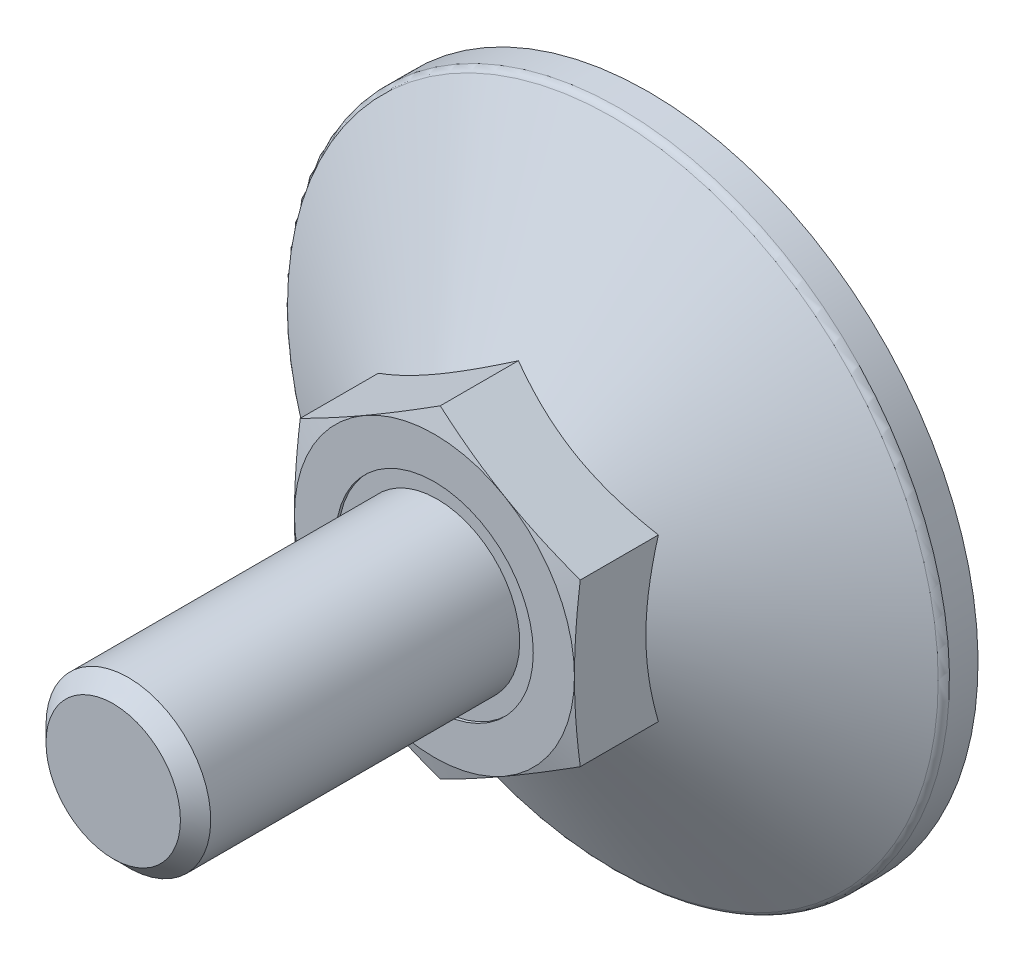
ISO-10303-21;
HEADER;
FILE_DESCRIPTION(('STEP AP214'),'2;1');
FILE_NAME('part.step','',(''),(''),'','','');
FILE_SCHEMA(('AUTOMOTIVE_DESIGN { 1 0 10303 214 1 1 1 1 }'));
ENDSEC;
DATA;
#1=APPLICATION_CONTEXT('core data for automotive mechanical design processes');
#2=APPLICATION_PROTOCOL_DEFINITION('international standard','automotive_design',2000,#1);
#3=PRODUCT_CONTEXT('',#1,'mechanical');
#4=PRODUCT('Part','Part','',(#3));
#5=PRODUCT_RELATED_PRODUCT_CATEGORY('part','',(#4));
#6=PRODUCT_DEFINITION_FORMATION('','',#4);
#7=PRODUCT_DEFINITION_CONTEXT('part definition',#1,'design');
#8=PRODUCT_DEFINITION('design','',#6,#7);
#9=PRODUCT_DEFINITION_SHAPE('','',#8);
#10=(LENGTH_UNIT() NAMED_UNIT(*) SI_UNIT(.MILLI.,.METRE.));
#11=(NAMED_UNIT(*) PLANE_ANGLE_UNIT() SI_UNIT($,.RADIAN.));
#12=(NAMED_UNIT(*) SI_UNIT($,.STERADIAN.) SOLID_ANGLE_UNIT());
#13=UNCERTAINTY_MEASURE_WITH_UNIT(LENGTH_MEASURE(1.E-05),#10,'distance_accuracy_value','');
#14=(GEOMETRIC_REPRESENTATION_CONTEXT(3) GLOBAL_UNCERTAINTY_ASSIGNED_CONTEXT((#13)) GLOBAL_UNIT_ASSIGNED_CONTEXT((#10,
#11,#12)) REPRESENTATION_CONTEXT('',''));
#15=CARTESIAN_POINT('',(0.,0.,0.));
#16=DIRECTION('',(0.,0.,1.));
#17=DIRECTION('',(1.,0.,0.));
#18=AXIS2_PLACEMENT_3D('',#15,#16,#17);
#19=CARTESIAN_POINT('',(0.,9.8149545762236,27.));
#20=DIRECTION('',(0.5,-0.86602540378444,0.));
#21=DIRECTION('',(0.86602540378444,0.5,0.));
#22=AXIS2_PLACEMENT_3D('',#19,#20,#21);
#23=PLANE('',#22);
#24=CARTESIAN_POINT('',(0.000200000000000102,9.81507004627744,12.6476280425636));
#25=CARTESIAN_POINT('',(-0.352800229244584,9.61126526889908,12.7022599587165));
#26=CARTESIAN_POINT('',(-0.706440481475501,9.40709097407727,12.7518566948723));
#27=CARTESIAN_POINT('',(-1.41496987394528,8.99802133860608,12.8389934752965));
#28=CARTESIAN_POINT('',(-1.76985946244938,8.79312573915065,12.8765286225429));
#29=CARTESIAN_POINT('',(-2.47873586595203,8.38385575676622,12.9373509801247));
#30=CARTESIAN_POINT('',(-2.83271788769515,8.17948414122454,12.9607107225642));
#31=CARTESIAN_POINT('',(-3.5411333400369,7.77048028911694,12.9920337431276));
#32=CARTESIAN_POINT('',(-3.89556667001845,7.56584811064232,13.));
#33=CARTESIAN_POINT('',(-4.60443332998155,7.15658375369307,13.));
#34=CARTESIAN_POINT('',(-4.9588666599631,6.95195157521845,12.9920337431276));
#35=CARTESIAN_POINT('',(-5.66728211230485,6.54294772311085,12.9607107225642));
#36=CARTESIAN_POINT('',(-6.02126413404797,6.33857610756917,12.9373509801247));
#37=CARTESIAN_POINT('',(-6.73014053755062,5.92930612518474,12.8765286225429));
#38=CARTESIAN_POINT('',(-7.08503012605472,5.7244105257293,12.8389934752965));
#39=CARTESIAN_POINT('',(-7.7935595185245,5.31534089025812,12.7518566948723));
#40=CARTESIAN_POINT('',(-8.14719977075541,5.11116659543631,12.7022599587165));
#41=CARTESIAN_POINT('',(-8.5002,4.90736181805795,12.6476280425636));
#42=B_SPLINE_CURVE_WITH_KNOTS('',3,(#24,#25,#26,#27,#28,#29,#30,#31,#32,#33,#34,#35,#36,#37,#38,
#39,#40,#41),.UNSPECIFIED.,.F.,.F.,(4,2,2,2,2,2,2,2,4),(0.,1.23382789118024,2.46815608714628,
3.69611406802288,4.92383440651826,6.15155474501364,7.37951272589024,8.61384092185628,
9.84766881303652),.UNSPECIFIED.);
#43=CARTESIAN_POINT('',(0.,9.8149545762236,12.6476589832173));
#44=VERTEX_POINT('',#43);
#45=CARTESIAN_POINT('',(-4.25,7.3612159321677,13.));
#46=VERTEX_POINT('',#45);
#47=EDGE_CURVE('E268',#44,#46,#42,.T.);
#48=ORIENTED_EDGE('',*,*,#47,.F.);
#49=DIRECTION('',(0.,0.,-1.));
#50=VECTOR('',#49,1.);
#51=CARTESIAN_POINT('',(0.,9.8149545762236,27.));
#52=LINE('',#51,#50);
#53=CARTESIAN_POINT('',(0.,9.8149545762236,7.90533871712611));
#54=VERTEX_POINT('',#53);
#55=EDGE_CURVE('E43',#44,#54,#52,.T.);
#56=ORIENTED_EDGE('',*,*,#55,.T.);
#57=CARTESIAN_POINT('',(-8.5002,4.90736181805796,7.90527204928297));
#58=CARTESIAN_POINT('',(-8.31336077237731,5.0152334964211,7.96754195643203));
#59=CARTESIAN_POINT('',(-8.1258249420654,5.12350735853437,8.02698579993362));
#60=CARTESIAN_POINT('',(-7.74923024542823,5.34093440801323,8.13944298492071));
#61=CARTESIAN_POINT('',(-7.56017075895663,5.45008795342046,8.19245355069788));
#62=CARTESIAN_POINT('',(-6.98996524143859,5.77929626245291,8.34079470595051));
#63=CARTESIAN_POINT('',(-6.60656835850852,6.00065055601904,8.42516916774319));
#64=CARTESIAN_POINT('',(-6.03282233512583,6.33190297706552,8.52410807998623));
#65=CARTESIAN_POINT('',(-5.8441872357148,6.44081150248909,8.55229289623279));
#66=CARTESIAN_POINT('',(-5.46606397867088,6.65912106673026,8.59955401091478));
#67=CARTESIAN_POINT('',(-5.27657589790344,6.76852206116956,8.61863111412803));
#68=CARTESIAN_POINT('',(-4.89727347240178,6.98751241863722,8.64719332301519));
#69=CARTESIAN_POINT('',(-4.70745974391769,7.0971014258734,8.65668931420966));
#70=CARTESIAN_POINT('',(-4.3276569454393,7.31638067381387,8.66588571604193));
#71=CARTESIAN_POINT('',(-4.13766788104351,7.42607091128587,8.66558642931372));
#72=CARTESIAN_POINT('',(-3.78247698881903,7.63114046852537,8.65587362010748));
#73=CARTESIAN_POINT('',(-3.61725009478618,7.7265342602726,8.64764492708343));
#74=CARTESIAN_POINT('',(-3.28718328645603,7.91709842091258,8.62393885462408));
#75=CARTESIAN_POINT('',(-3.12234339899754,8.01226877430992,8.60846098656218));
#76=CARTESIAN_POINT('',(-2.62846189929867,8.29741139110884,8.55151947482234));
#77=CARTESIAN_POINT('',(-2.30029449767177,8.48687892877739,8.49955503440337));
#78=CARTESIAN_POINT('',(-1.64047857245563,8.86782383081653,8.36964315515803));
#79=CARTESIAN_POINT('',(-1.30891425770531,9.0592525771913,8.29114502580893));
#80=CARTESIAN_POINT('',(-0.650730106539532,9.43925537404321,8.11298675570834));
#81=CARTESIAN_POINT('',(-0.324101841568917,9.62783429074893,8.01336845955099));
#82=CARTESIAN_POINT('',(0.000199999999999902,9.81507004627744,7.90527204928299));
#83=B_SPLINE_CURVE_WITH_KNOTS('',3,(#57,#58,#59,#60,#61,#62,#63,#64,#65,#66,#67,#68,#69,#70,#71,
#72,#73,#74,#75,#76,#77,#78,#79,#80,#81,#82),.UNSPECIFIED.,.F.,.F.,(4,2,2,2,2,2,2,2,2,2,2,2,4),
(0.,0.673596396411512,1.34748239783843,2.69805431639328,3.35679995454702,4.01548737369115,
4.67342558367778,5.33134346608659,5.90409556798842,6.47688628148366,7.62328361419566,
8.79510569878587,9.96462743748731),.UNSPECIFIED.);
#84=CARTESIAN_POINT('',(-8.5,4.9074772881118,7.90533871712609));
#85=VERTEX_POINT('',#84);
#86=EDGE_CURVE('E236',#85,#54,#83,.T.);
#87=ORIENTED_EDGE('',*,*,#86,.F.);
#88=DIRECTION('',(0.,0.,-1.));
#89=VECTOR('',#88,1.);
#90=CARTESIAN_POINT('',(-8.5,4.9074772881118,27.));
#91=LINE('',#90,#89);
#92=CARTESIAN_POINT('',(-8.5,4.9074772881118,12.6476589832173));
#93=VERTEX_POINT('',#92);
#94=EDGE_CURVE('E281',#93,#85,#91,.T.);
#95=ORIENTED_EDGE('',*,*,#94,.F.);
#96=EDGE_CURVE('E168',#46,#93,#42,.T.);
#97=ORIENTED_EDGE('',*,*,#96,.F.);
#98=EDGE_LOOP('',(#48,#56,#87,#95,#97));
#99=FACE_BOUND('',#98,.T.);
#100=ADVANCED_FACE('F14',(#99),#23,.F.);
#101=CARTESIAN_POINT('',(8.5,4.9074772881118,27.));
#102=DIRECTION('',(-0.5,-0.86602540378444,0.));
#103=DIRECTION('',(0.86602540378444,-0.5,0.));
#104=AXIS2_PLACEMENT_3D('',#101,#102,#103);
#105=PLANE('',#104);
#106=CARTESIAN_POINT('',(8.5002,4.90736181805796,12.6476280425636));
#107=CARTESIAN_POINT('',(8.14719977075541,5.11116659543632,12.7022599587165));
#108=CARTESIAN_POINT('',(7.7935595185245,5.31534089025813,12.7518566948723));
#109=CARTESIAN_POINT('',(7.08503012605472,5.72441052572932,12.8389934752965));
#110=CARTESIAN_POINT('',(6.73014053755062,5.92930612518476,12.8765286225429));
#111=CARTESIAN_POINT('',(6.02126413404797,6.33857610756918,12.9373509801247));
#112=CARTESIAN_POINT('',(5.66728211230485,6.54294772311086,12.9607107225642));
#113=CARTESIAN_POINT('',(4.9588666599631,6.95195157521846,12.9920337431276));
#114=CARTESIAN_POINT('',(4.60443332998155,7.15658375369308,13.));
#115=CARTESIAN_POINT('',(3.89556667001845,7.56584811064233,13.));
#116=CARTESIAN_POINT('',(3.5411333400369,7.77048028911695,12.9920337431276));
#117=CARTESIAN_POINT('',(2.83271788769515,8.17948414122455,12.9607107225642));
#118=CARTESIAN_POINT('',(2.47873586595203,8.38385575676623,12.9373509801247));
#119=CARTESIAN_POINT('',(1.76985946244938,8.79312573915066,12.8765286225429));
#120=CARTESIAN_POINT('',(1.41496987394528,8.9980213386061,12.8389934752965));
#121=CARTESIAN_POINT('',(0.706440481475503,9.40709097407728,12.7518566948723));
#122=CARTESIAN_POINT('',(0.352800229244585,9.61126526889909,12.7022599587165));
#123=CARTESIAN_POINT('',(-0.000200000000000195,9.81507004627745,12.6476280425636));
#124=B_SPLINE_CURVE_WITH_KNOTS('',3,(#106,#107,#108,#109,#110,#111,#112,#113,#114,#115,#116,
#117,#118,#119,#120,#121,#122,#123),.UNSPECIFIED.,.F.,.F.,(4,2,2,2,2,2,2,2,4),(0.,
1.23382789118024,2.46815608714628,3.69611406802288,4.92383440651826,6.15155474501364,
7.37951272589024,8.61384092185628,9.84766881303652),.UNSPECIFIED.);
#125=CARTESIAN_POINT('',(8.5,4.9074772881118,12.6476589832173));
#126=VERTEX_POINT('',#125);
#127=CARTESIAN_POINT('',(4.25,7.36121593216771,13.));
#128=VERTEX_POINT('',#127);
#129=EDGE_CURVE('E120',#126,#128,#124,.T.);
#130=ORIENTED_EDGE('',*,*,#129,.F.);
#131=DIRECTION('',(0.,0.,-1.));
#132=VECTOR('',#131,1.);
#133=CARTESIAN_POINT('',(8.5,4.9074772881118,27.));
#134=LINE('',#133,#132);
#135=CARTESIAN_POINT('',(8.5,4.9074772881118,7.90533871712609));
#136=VERTEX_POINT('',#135);
#137=EDGE_CURVE('E127',#126,#136,#134,.T.);
#138=ORIENTED_EDGE('',*,*,#137,.T.);
#139=CARTESIAN_POINT('',(-0.0002,9.81507004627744,7.90527204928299));
#140=CARTESIAN_POINT('',(0.186639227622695,9.7071983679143,7.96754195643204));
#141=CARTESIAN_POINT('',(0.374175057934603,9.59892450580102,8.02698579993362));
#142=CARTESIAN_POINT('',(0.750769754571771,9.38149745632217,8.13944298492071));
#143=CARTESIAN_POINT('',(0.939829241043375,9.27234391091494,8.19245355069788));
#144=CARTESIAN_POINT('',(1.51003475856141,8.94313560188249,8.34079470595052));
#145=CARTESIAN_POINT('',(1.89343164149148,8.72178130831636,8.42516916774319));
#146=CARTESIAN_POINT('',(2.46717766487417,8.39052888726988,8.52410807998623));
#147=CARTESIAN_POINT('',(2.6558127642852,8.28162036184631,8.55229289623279));
#148=CARTESIAN_POINT('',(3.03393602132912,8.06331079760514,8.59955401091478));
#149=CARTESIAN_POINT('',(3.22342410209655,7.95390980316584,8.61863111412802));
#150=CARTESIAN_POINT('',(3.60272652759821,7.73491944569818,8.64719332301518));
#151=CARTESIAN_POINT('',(3.79254025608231,7.62533043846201,8.65668931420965));
#152=CARTESIAN_POINT('',(4.1723430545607,7.40605119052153,8.66588571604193));
#153=CARTESIAN_POINT('',(4.36233211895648,7.29636095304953,8.66558642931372));
#154=CARTESIAN_POINT('',(4.71752301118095,7.09129139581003,8.65587362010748));
#155=CARTESIAN_POINT('',(4.88274990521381,6.9958976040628,8.64764492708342));
#156=CARTESIAN_POINT('',(5.21281671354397,6.80533344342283,8.62393885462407));
#157=CARTESIAN_POINT('',(5.37765660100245,6.71016309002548,8.60846098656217));
#158=CARTESIAN_POINT('',(5.87153810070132,6.42502047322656,8.55151947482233));
#159=CARTESIAN_POINT('',(6.19970550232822,6.23555293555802,8.49955503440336));
#160=CARTESIAN_POINT('',(6.85952142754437,5.85460803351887,8.36964315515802));
#161=CARTESIAN_POINT('',(7.19108574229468,5.6631792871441,8.29114502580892));
#162=CARTESIAN_POINT('',(7.84926989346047,5.28317649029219,8.11298675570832));
#163=CARTESIAN_POINT('',(8.17589815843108,5.09459757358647,8.01336845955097));
#164=CARTESIAN_POINT('',(8.5002,4.90736181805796,7.90527204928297));
#165=B_SPLINE_CURVE_WITH_KNOTS('',3,(#139,#140,#141,#142,#143,#144,#145,#146,#147,#148,#149,
#150,#151,#152,#153,#154,#155,#156,#157,#158,#159,#160,#161,#162,#163,#164),.UNSPECIFIED.,.F.,
.F.,(4,2,2,2,2,2,2,2,2,2,2,2,4),(0.,0.673596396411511,1.34748239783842,2.69805431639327,
3.35679995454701,4.01548737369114,4.67342558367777,5.33134346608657,5.90409556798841,
6.47688628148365,7.62328361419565,8.79510569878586,9.96462743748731),.UNSPECIFIED.);
#166=EDGE_CURVE('E230',#54,#136,#165,.T.);
#167=ORIENTED_EDGE('',*,*,#166,.F.);
#168=ORIENTED_EDGE('',*,*,#55,.F.);
#169=EDGE_CURVE('E137',#128,#44,#124,.T.);
#170=ORIENTED_EDGE('',*,*,#169,.F.);
#171=EDGE_LOOP('',(#130,#138,#167,#168,#170));
#172=FACE_BOUND('',#171,.T.);
#173=ADVANCED_FACE('F242',(#172),#105,.F.);
#174=CARTESIAN_POINT('',(8.5,-4.9074772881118,27.));
#175=DIRECTION('',(-1.,0.,0.));
#176=DIRECTION('',(0.,-1.,0.));
#177=AXIS2_PLACEMENT_3D('',#174,#175,#176);
#178=PLANE('',#177);
#179=CARTESIAN_POINT('',(8.5,-13.0013964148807,11.1154079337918));
#180=CARTESIAN_POINT('',(8.5,-12.6155551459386,11.2019183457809));
#181=CARTESIAN_POINT('',(8.5,-12.2294730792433,11.2873739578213));
#182=CARTESIAN_POINT('',(8.5,-11.4567090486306,11.4556061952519));
#183=CARTESIAN_POINT('',(8.5,-11.0700270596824,11.5383827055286));
#184=CARTESIAN_POINT('',(8.5,-10.2956012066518,11.7007588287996));
#185=CARTESIAN_POINT('',(8.5,-9.90785667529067,11.7803552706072));
#186=CARTESIAN_POINT('',(8.5,-9.13156196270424,11.9355151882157));
#187=CARTESIAN_POINT('',(8.5,-8.74301178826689,12.0110786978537));
#188=CARTESIAN_POINT('',(8.5,-7.96806084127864,12.1566302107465));
#189=CARTESIAN_POINT('',(8.5,-7.58166753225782,12.2266577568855));
#190=CARTESIAN_POINT('',(8.5,-6.80782802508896,12.3606202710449));
#191=CARTESIAN_POINT('',(8.5,-6.42038185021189,12.4245553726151));
#192=CARTESIAN_POINT('',(8.5,-5.64435908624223,12.5448975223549));
#193=CARTESIAN_POINT('',(8.5,-5.25578263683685,12.6013054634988));
#194=CARTESIAN_POINT('',(8.5,-4.47739258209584,12.7049345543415));
#195=CARTESIAN_POINT('',(8.5,-4.08757897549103,12.7521556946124));
#196=CARTESIAN_POINT('',(8.5,-3.30230870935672,12.8360782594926));
#197=CARTESIAN_POINT('',(8.5,-2.90683837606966,12.8726536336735));
#198=CARTESIAN_POINT('',(8.5,-2.11489932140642,12.9327640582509));
#199=CARTESIAN_POINT('',(8.5,-1.71843062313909,12.956299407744));
#200=CARTESIAN_POINT('',(8.5,-0.925070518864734,12.9889573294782));
#201=CARTESIAN_POINT('',(8.5,-0.528179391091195,12.9980865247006));
#202=CARTESIAN_POINT('',(8.5,0.265665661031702,13.0013704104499));
#203=CARTESIAN_POINT('',(8.5,0.662619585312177,12.9955251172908));
#204=CARTESIAN_POINT('',(8.5,1.45747811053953,12.9691885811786));
#205=CARTESIAN_POINT('',(8.5,1.85538091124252,12.9486440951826));
#206=CARTESIAN_POINT('',(8.5,2.65025329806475,12.8940836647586));
#207=CARTESIAN_POINT('',(8.5,3.04722286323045,12.8600674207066));
#208=CARTESIAN_POINT('',(8.5,3.84022498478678,12.7802865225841));
#209=CARTESIAN_POINT('',(8.5,4.2362567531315,12.7345141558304));
#210=CARTESIAN_POINT('',(8.5,5.02704500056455,12.6331315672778));
#211=CARTESIAN_POINT('',(8.5,5.42180147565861,12.5775213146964));
#212=CARTESIAN_POINT('',(8.5,6.18542338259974,12.4619782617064));
#213=CARTESIAN_POINT('',(8.5,6.55436342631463,12.4025335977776));
#214=CARTESIAN_POINT('',(8.5,7.29126654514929,12.2778420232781));
#215=CARTESIAN_POINT('',(8.5,7.65922959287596,12.2125949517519));
#216=CARTESIAN_POINT('',(8.5,8.39431434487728,12.0773627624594));
#217=CARTESIAN_POINT('',(8.5,8.76143596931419,12.0073772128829));
#218=CARTESIAN_POINT('',(8.5,9.49492383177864,11.8635427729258));
#219=CARTESIAN_POINT('',(8.5,9.86129005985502,11.7896938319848));
#220=CARTESIAN_POINT('',(8.5,10.5934540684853,11.6388171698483));
#221=CARTESIAN_POINT('',(8.5,10.9592516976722,11.5617887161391));
#222=CARTESIAN_POINT('',(8.5,11.6902889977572,11.4051243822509));
#223=CARTESIAN_POINT('',(8.5,12.0555286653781,11.3254884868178));
#224=CARTESIAN_POINT('',(8.5,13.1504861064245,11.0833759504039));
#225=CARTESIAN_POINT('',(8.5,13.8794926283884,10.9176839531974));
#226=CARTESIAN_POINT('',(8.5,15.3289393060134,10.5819886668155));
#227=CARTESIAN_POINT('',(8.5,16.0493931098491,10.412043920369));
#228=CARTESIAN_POINT('',(8.5,17.4892972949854,10.0679042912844));
#229=CARTESIAN_POINT('',(8.5,18.2087476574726,9.89370933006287));
#230=CARTESIAN_POINT('',(8.5,19.6459829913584,9.54240508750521));
#231=CARTESIAN_POINT('',(8.5,20.3637689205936,9.36529971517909));
#232=CARTESIAN_POINT('',(8.5,21.798716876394,9.00867881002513));
#233=CARTESIAN_POINT('',(8.5,22.5158789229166,8.8291633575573));
#234=CARTESIAN_POINT('',(8.5,23.2328239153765,8.64879480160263));
#235=B_SPLINE_CURVE_WITH_KNOTS('',3,(#179,#180,#181,#182,#183,#184,#185,#186,#187,#188,#189,
#190,#191,#192,#193,#194,#195,#196,#197,#198,#199,#200,#201,#202,#203,#204,#205,#206,#207,#208,
#209,#210,#211,#212,#213,#214,#215,#216,#217,#218,#219,#220,#221,#222,#223,#224,#225,#226,#227,
#228,#229,#230,#231,#232,#233,#234),.UNSPECIFIED.,.F.,.F.,(4,2,2,2,2,2,2,2,2,2,2,2,2,2,2,2,2,2,
2,2,2,2,2,2,2,2,2,4),(0.,1.18626692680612,2.37258475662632,3.56005747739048,4.74752023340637,
5.92554444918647,7.10354283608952,8.28140134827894,9.45926106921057,10.6505472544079,
11.8418061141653,13.032517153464,14.2232268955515,15.4182715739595,16.6133428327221,
17.8092001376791,19.0050611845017,20.1261014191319,21.2471727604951,22.3683464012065,
23.4895347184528,24.6109827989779,25.7324374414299,27.9751925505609,30.1958563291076,
32.4165611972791,34.6344942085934,36.8523534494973),.UNSPECIFIED.);
#236=CARTESIAN_POINT('',(8.5,-4.90747728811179,12.6476589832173));
#237=VERTEX_POINT('',#236);
#238=CARTESIAN_POINT('',(8.5,0.,13.));
#239=VERTEX_POINT('',#238);
#240=EDGE_CURVE('E95',#237,#239,#235,.T.);
#241=ORIENTED_EDGE('',*,*,#240,.F.);
#242=DIRECTION('',(0.,0.,-1.));
#243=VECTOR('',#242,1.);
#244=CARTESIAN_POINT('',(8.5,-4.9074772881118,27.));
#245=LINE('',#244,#243);
#246=CARTESIAN_POINT('',(8.5,-4.9074772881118,7.90533871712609));
#247=VERTEX_POINT('',#246);
#248=EDGE_CURVE('E274',#237,#247,#245,.T.);
#249=ORIENTED_EDGE('',*,*,#248,.T.);
#250=CARTESIAN_POINT('',(8.5,12.7492767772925,4.72527230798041));
#251=CARTESIAN_POINT('',(8.5,12.3811478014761,4.90206026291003));
#252=CARTESIAN_POINT('',(8.5,12.0121249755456,5.07702151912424));
#253=CARTESIAN_POINT('',(8.5,11.2718137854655,5.42225230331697));
#254=CARTESIAN_POINT('',(8.5,10.9005250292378,5.59252098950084));
#255=CARTESIAN_POINT('',(8.5,10.1530767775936,5.92827896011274));
#256=CARTESIAN_POINT('',(8.5,9.77690140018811,6.09373302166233));
#257=CARTESIAN_POINT('',(8.5,9.02139912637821,6.41725455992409));
#258=CARTESIAN_POINT('',(8.5,8.64207239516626,6.57532242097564));
#259=CARTESIAN_POINT('',(8.5,7.86979942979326,6.88607334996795));
#260=CARTESIAN_POINT('',(8.5,7.47675434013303,7.03851219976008));
#261=CARTESIAN_POINT('',(8.5,6.68591204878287,7.33076935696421));
#262=CARTESIAN_POINT('',(8.5,6.28811429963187,7.47058619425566));
#263=CARTESIAN_POINT('',(8.5,5.48802263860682,7.733611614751));
#264=CARTESIAN_POINT('',(8.5,5.08574124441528,7.85685783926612));
#265=CARTESIAN_POINT('',(8.5,4.27544970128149,8.08251258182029));
#266=CARTESIAN_POINT('',(8.5,3.86744153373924,8.18492812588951));
#267=CARTESIAN_POINT('',(8.5,3.04728386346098,8.36327495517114));
#268=CARTESIAN_POINT('',(8.5,2.6351585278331,8.43931422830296));
#269=CARTESIAN_POINT('',(8.5,2.01359122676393,8.53003978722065));
#270=CARTESIAN_POINT('',(8.5,1.80582110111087,8.55639399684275));
#271=CARTESIAN_POINT('',(8.5,1.38940213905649,8.60080126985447));
#272=CARTESIAN_POINT('',(8.5,1.18075338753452,8.61885511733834));
#273=CARTESIAN_POINT('',(8.5,0.765376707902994,8.64609671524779));
#274=CARTESIAN_POINT('',(8.5,0.558655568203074,8.65538769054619));
#275=CARTESIAN_POINT('',(8.5,0.1450067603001,8.66526416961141));
#276=CARTESIAN_POINT('',(8.5,-0.0619209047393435,8.6658498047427));
#277=CARTESIAN_POINT('',(8.5,-0.475626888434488,8.65830085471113));
#278=CARTESIAN_POINT('',(8.5,-0.682405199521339,8.65016585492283));
#279=CARTESIAN_POINT('',(8.5,-1.09545270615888,8.625363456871));
#280=CARTESIAN_POINT('',(8.5,-1.30172187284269,8.60869558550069));
#281=CARTESIAN_POINT('',(8.5,-1.81090940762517,8.55735076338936));
#282=CARTESIAN_POINT('',(8.5,-2.11335210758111,8.51788364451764));
#283=CARTESIAN_POINT('',(8.5,-2.71570235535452,8.4228634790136));
#284=CARTESIAN_POINT('',(8.5,-3.01560949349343,8.36730788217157));
#285=CARTESIAN_POINT('',(8.5,-3.61268959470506,8.2420877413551));
#286=CARTESIAN_POINT('',(8.5,-3.90986014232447,8.17241178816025));
#287=CARTESIAN_POINT('',(8.5,-4.50108875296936,8.02104250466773));
#288=CARTESIAN_POINT('',(8.5,-4.79514688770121,7.93934945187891));
#289=CARTESIAN_POINT('',(8.5,-5.3871494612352,7.7638116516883));
#290=CARTESIAN_POINT('',(8.5,-5.68502188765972,7.6697256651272));
#291=CARTESIAN_POINT('',(8.5,-6.27782977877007,7.4727599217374));
#292=CARTESIAN_POINT('',(8.5,-6.57276522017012,7.36988009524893));
#293=CARTESIAN_POINT('',(8.5,-7.15987047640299,7.15687683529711));
#294=CARTESIAN_POINT('',(8.5,-7.45204129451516,7.04675615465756));
#295=CARTESIAN_POINT('',(8.5,-8.03401937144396,6.82048197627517));
#296=CARTESIAN_POINT('',(8.5,-8.32382669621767,6.70432864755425));
#297=CARTESIAN_POINT('',(8.5,-8.8985343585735,6.468166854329));
#298=CARTESIAN_POINT('',(8.5,-9.18345493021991,6.34820749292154));
#299=CARTESIAN_POINT('',(8.5,-9.75152375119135,6.10415692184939));
#300=CARTESIAN_POINT('',(8.5,-10.034671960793,5.98006561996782));
#301=CARTESIAN_POINT('',(8.5,-10.8818575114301,5.60257794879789));
#302=CARTESIAN_POINT('',(8.5,-11.4435817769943,5.34399030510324));
#303=CARTESIAN_POINT('',(8.5,-12.5625477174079,4.81675169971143));
#304=CARTESIAN_POINT('',(8.5,-13.1197873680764,4.54809647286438));
#305=CARTESIAN_POINT('',(8.5,-14.2306052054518,4.00340707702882));
#306=CARTESIAN_POINT('',(8.5,-14.7841835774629,3.72737328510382));
#307=CARTESIAN_POINT('',(8.5,-15.8894273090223,3.16924748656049));
#308=CARTESIAN_POINT('',(8.5,-16.4410879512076,2.88714616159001));
#309=CARTESIAN_POINT('',(8.5,-17.5421722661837,2.31860293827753));
#310=CARTESIAN_POINT('',(8.5,-18.0915959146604,2.03216099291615));
#311=CARTESIAN_POINT('',(8.5,-19.1885131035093,1.45593769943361));
#312=CARTESIAN_POINT('',(8.5,-19.7360070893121,1.1661571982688));
#313=CARTESIAN_POINT('',(8.5,-20.8295421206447,0.583866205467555));
#314=CARTESIAN_POINT('',(8.5,-21.3755831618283,0.291355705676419));
#315=CARTESIAN_POINT('',(8.5,-22.8810608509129,-0.519031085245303));
#316=CARTESIAN_POINT('',(8.5,-23.8392547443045,-1.03921546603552));
#317=CARTESIAN_POINT('',(8.5,-25.7530641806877,-2.08445783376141));
#318=CARTESIAN_POINT('',(8.5,-26.708679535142,-2.60951616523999));
#319=CARTESIAN_POINT('',(8.5,-28.6148788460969,-3.66152013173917));
#320=CARTESIAN_POINT('',(8.5,-29.565469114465,-4.18845433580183));
#321=CARTESIAN_POINT('',(8.5,-30.9901906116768,-4.98085413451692));
#322=CARTESIAN_POINT('',(8.5,-31.4648842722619,-5.24530955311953));
#323=CARTESIAN_POINT('',(8.5,-32.4139385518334,-5.77481644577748));
#324=CARTESIAN_POINT('',(8.5,-32.8882991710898,-6.03986791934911));
#325=CARTESIAN_POINT('',(8.5,-33.3625145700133,-6.30517901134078));
#326=B_SPLINE_CURVE_WITH_KNOTS('',3,(#250,#251,#252,#253,#254,#255,#256,#257,#258,#259,#260,
#261,#262,#263,#264,#265,#266,#267,#268,#269,#270,#271,#272,#273,#274,#275,#276,#277,#278,#279,
#280,#281,#282,#283,#284,#285,#286,#287,#288,#289,#290,#291,#292,#293,#294,#295,#296,#297,#298,
#299,#300,#301,#302,#303,#304,#305,#306,#307,#308,#309,#310,#311,#312,#313,#314,#315,#316,#317,
#318,#319,#320,#321,#322,#323,#324,#325),.UNSPECIFIED.,.F.,.F.,(4,2,2,2,2,2,2,2,2,2,2,2,2,2,2,2,
2,2,2,2,2,2,2,2,2,2,2,2,2,2,2,2,2,2,2,2,2,4),(0.,1.22515253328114,2.45052343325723,
3.6833213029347,4.91605495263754,6.18059988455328,7.44529191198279,8.70706073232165,
9.96840325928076,11.2245189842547,11.852683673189,12.4807890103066,13.1013994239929,
13.7220004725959,14.3426310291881,14.9632960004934,15.8778021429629,16.7924533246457,
17.7078465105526,18.6232185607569,19.5601888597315,20.4971665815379,21.433790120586,
22.3703874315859,23.297780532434,24.225194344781,26.0801973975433,27.9359954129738,
29.7916987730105,31.6504906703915,33.5093027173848,35.3676531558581,37.2260091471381,
40.4968499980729,43.7679238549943,47.0285209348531,48.6586852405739,50.2888482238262),.UNSPECIFIED.);
#327=EDGE_CURVE('E196',#136,#247,#326,.T.);
#328=ORIENTED_EDGE('',*,*,#327,.F.);
#329=ORIENTED_EDGE('',*,*,#137,.F.);
#330=EDGE_CURVE('E106',#239,#126,#235,.T.);
#331=ORIENTED_EDGE('',*,*,#330,.F.);
#332=EDGE_LOOP('',(#241,#249,#328,#329,#331));
#333=FACE_BOUND('',#332,.T.);
#334=ADVANCED_FACE('F125',(#333),#178,.F.);
#335=CARTESIAN_POINT('',(0.,-9.8149545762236,27.));
#336=DIRECTION('',(-0.5,0.86602540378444,0.));
#337=DIRECTION('',(-0.86602540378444,-0.5,0.));
#338=AXIS2_PLACEMENT_3D('',#335,#336,#337);
#339=PLANE('',#338);
#340=CARTESIAN_POINT('',(-0.000200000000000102,-9.81507004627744,12.6476280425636));
#341=CARTESIAN_POINT('',(0.352800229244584,-9.61126526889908,12.7022599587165));
#342=CARTESIAN_POINT('',(0.706440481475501,-9.40709097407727,12.7518566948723));
#343=CARTESIAN_POINT('',(1.41496987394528,-8.99802133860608,12.8389934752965));
#344=CARTESIAN_POINT('',(1.76985946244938,-8.79312573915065,12.8765286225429));
#345=CARTESIAN_POINT('',(2.47873586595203,-8.38385575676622,12.9373509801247));
#346=CARTESIAN_POINT('',(2.83271788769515,-8.17948414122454,12.9607107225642));
#347=CARTESIAN_POINT('',(3.5411333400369,-7.77048028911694,12.9920337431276));
#348=CARTESIAN_POINT('',(3.89556667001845,-7.56584811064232,13.));
#349=CARTESIAN_POINT('',(4.60443332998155,-7.15658375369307,13.));
#350=CARTESIAN_POINT('',(4.9588666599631,-6.95195157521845,12.9920337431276));
#351=CARTESIAN_POINT('',(5.66728211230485,-6.54294772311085,12.9607107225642));
#352=CARTESIAN_POINT('',(6.02126413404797,-6.33857610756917,12.9373509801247));
#353=CARTESIAN_POINT('',(6.73014053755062,-5.92930612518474,12.8765286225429));
#354=CARTESIAN_POINT('',(7.08503012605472,-5.7244105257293,12.8389934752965));
#355=CARTESIAN_POINT('',(7.7935595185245,-5.31534089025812,12.7518566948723));
#356=CARTESIAN_POINT('',(8.14719977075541,-5.11116659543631,12.7022599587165));
#357=CARTESIAN_POINT('',(8.5002,-4.90736181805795,12.6476280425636));
#358=B_SPLINE_CURVE_WITH_KNOTS('',3,(#340,#341,#342,#343,#344,#345,#346,#347,#348,#349,#350,
#351,#352,#353,#354,#355,#356,#357),.UNSPECIFIED.,.F.,.F.,(4,2,2,2,2,2,2,2,4),(0.,
1.23382789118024,2.46815608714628,3.69611406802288,4.92383440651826,6.15155474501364,
7.37951272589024,8.61384092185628,9.84766881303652),.UNSPECIFIED.);
#359=CARTESIAN_POINT('',(0.,-9.81495457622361,12.6476589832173));
#360=VERTEX_POINT('',#359);
#361=CARTESIAN_POINT('',(4.25,-7.3612159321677,13.));
#362=VERTEX_POINT('',#361);
#363=EDGE_CURVE('E129',#360,#362,#358,.T.);
#364=ORIENTED_EDGE('',*,*,#363,.F.);
#365=DIRECTION('',(0.,0.,-1.));
#366=VECTOR('',#365,1.);
#367=CARTESIAN_POINT('',(0.,-9.8149545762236,27.));
#368=LINE('',#367,#366);
#369=CARTESIAN_POINT('',(0.,-9.8149545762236,7.90533871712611));
#370=VERTEX_POINT('',#369);
#371=EDGE_CURVE('E278',#360,#370,#368,.T.);
#372=ORIENTED_EDGE('',*,*,#371,.T.);
#373=CARTESIAN_POINT('',(8.5002,-4.90736181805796,7.90527204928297));
#374=CARTESIAN_POINT('',(8.31336077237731,-5.0152334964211,7.96754195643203));
#375=CARTESIAN_POINT('',(8.1258249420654,-5.12350735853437,8.02698579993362));
#376=CARTESIAN_POINT('',(7.74923024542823,-5.34093440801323,8.13944298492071));
#377=CARTESIAN_POINT('',(7.56017075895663,-5.45008795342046,8.19245355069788));
#378=CARTESIAN_POINT('',(6.98996524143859,-5.77929626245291,8.34079470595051));
#379=CARTESIAN_POINT('',(6.60656835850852,-6.00065055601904,8.42516916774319));
#380=CARTESIAN_POINT('',(6.03282233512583,-6.33190297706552,8.52410807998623));
#381=CARTESIAN_POINT('',(5.8441872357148,-6.44081150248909,8.55229289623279));
#382=CARTESIAN_POINT('',(5.46606397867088,-6.65912106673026,8.59955401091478));
#383=CARTESIAN_POINT('',(5.27657589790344,-6.76852206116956,8.61863111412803));
#384=CARTESIAN_POINT('',(4.89727347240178,-6.98751241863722,8.64719332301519));
#385=CARTESIAN_POINT('',(4.70745974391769,-7.0971014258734,8.65668931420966));
#386=CARTESIAN_POINT('',(4.3276569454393,-7.31638067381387,8.66588571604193));
#387=CARTESIAN_POINT('',(4.13766788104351,-7.42607091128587,8.66558642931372));
#388=CARTESIAN_POINT('',(3.78247698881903,-7.63114046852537,8.65587362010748));
#389=CARTESIAN_POINT('',(3.61725009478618,-7.7265342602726,8.64764492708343));
#390=CARTESIAN_POINT('',(3.28718328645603,-7.91709842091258,8.62393885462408));
#391=CARTESIAN_POINT('',(3.12234339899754,-8.01226877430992,8.60846098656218));
#392=CARTESIAN_POINT('',(2.62846189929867,-8.29741139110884,8.55151947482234));
#393=CARTESIAN_POINT('',(2.30029449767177,-8.48687892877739,8.49955503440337));
#394=CARTESIAN_POINT('',(1.64047857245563,-8.86782383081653,8.36964315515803));
#395=CARTESIAN_POINT('',(1.30891425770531,-9.0592525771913,8.29114502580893));
#396=CARTESIAN_POINT('',(0.650730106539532,-9.43925537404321,8.11298675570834));
#397=CARTESIAN_POINT('',(0.324101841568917,-9.62783429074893,8.01336845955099));
#398=CARTESIAN_POINT('',(-0.000199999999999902,-9.81507004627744,7.90527204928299));
#399=B_SPLINE_CURVE_WITH_KNOTS('',3,(#373,#374,#375,#376,#377,#378,#379,#380,#381,#382,#383,
#384,#385,#386,#387,#388,#389,#390,#391,#392,#393,#394,#395,#396,#397,#398),.UNSPECIFIED.,.F.,
.F.,(4,2,2,2,2,2,2,2,2,2,2,2,4),(0.,0.673596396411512,1.34748239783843,2.69805431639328,
3.35679995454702,4.01548737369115,4.67342558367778,5.33134346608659,5.90409556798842,
6.47688628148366,7.62328361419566,8.79510569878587,9.96462743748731),.UNSPECIFIED.);
#400=EDGE_CURVE('E187',#247,#370,#399,.T.);
#401=ORIENTED_EDGE('',*,*,#400,.F.);
#402=ORIENTED_EDGE('',*,*,#248,.F.);
#403=EDGE_CURVE('E101',#362,#237,#358,.T.);
#404=ORIENTED_EDGE('',*,*,#403,.F.);
#405=EDGE_LOOP('',(#364,#372,#401,#402,#404));
#406=FACE_BOUND('',#405,.T.);
#407=ADVANCED_FACE('F179',(#406),#339,.F.);
#408=CARTESIAN_POINT('',(-8.5,-4.9074772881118,27.));
#409=DIRECTION('',(0.5,0.86602540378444,0.));
#410=DIRECTION('',(-0.86602540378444,0.5,0.));
#411=AXIS2_PLACEMENT_3D('',#408,#409,#410);
#412=PLANE('',#411);
#413=CARTESIAN_POINT('',(-8.5002,-4.90736181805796,12.6476280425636));
#414=CARTESIAN_POINT('',(-8.14719977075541,-5.11116659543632,12.7022599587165));
#415=CARTESIAN_POINT('',(-7.7935595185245,-5.31534089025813,12.7518566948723));
#416=CARTESIAN_POINT('',(-7.08503012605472,-5.72441052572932,12.8389934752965));
#417=CARTESIAN_POINT('',(-6.73014053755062,-5.92930612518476,12.8765286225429));
#418=CARTESIAN_POINT('',(-6.02126413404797,-6.33857610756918,12.9373509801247));
#419=CARTESIAN_POINT('',(-5.66728211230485,-6.54294772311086,12.9607107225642));
#420=CARTESIAN_POINT('',(-4.9588666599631,-6.95195157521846,12.9920337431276));
#421=CARTESIAN_POINT('',(-4.60443332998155,-7.15658375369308,13.));
#422=CARTESIAN_POINT('',(-3.89556667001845,-7.56584811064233,13.));
#423=CARTESIAN_POINT('',(-3.5411333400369,-7.77048028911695,12.9920337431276));
#424=CARTESIAN_POINT('',(-2.83271788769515,-8.17948414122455,12.9607107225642));
#425=CARTESIAN_POINT('',(-2.47873586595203,-8.38385575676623,12.9373509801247));
#426=CARTESIAN_POINT('',(-1.76985946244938,-8.79312573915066,12.8765286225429));
#427=CARTESIAN_POINT('',(-1.41496987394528,-8.9980213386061,12.8389934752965));
#428=CARTESIAN_POINT('',(-0.706440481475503,-9.40709097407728,12.7518566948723));
#429=CARTESIAN_POINT('',(-0.352800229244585,-9.61126526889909,12.7022599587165));
#430=CARTESIAN_POINT('',(0.000200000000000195,-9.81507004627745,12.6476280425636));
#431=B_SPLINE_CURVE_WITH_KNOTS('',3,(#413,#414,#415,#416,#417,#418,#419,#420,#421,#422,#423,
#424,#425,#426,#427,#428,#429,#430),.UNSPECIFIED.,.F.,.F.,(4,2,2,2,2,2,2,2,4),(0.,
1.23382789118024,2.46815608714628,3.69611406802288,4.92383440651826,6.15155474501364,
7.37951272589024,8.61384092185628,9.84766881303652),.UNSPECIFIED.);
#432=CARTESIAN_POINT('',(-8.5,-4.9074772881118,12.6476589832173));
#433=VERTEX_POINT('',#432);
#434=CARTESIAN_POINT('',(-4.25,-7.36121593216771,13.));
#435=VERTEX_POINT('',#434);
#436=EDGE_CURVE('E159',#433,#435,#431,.T.);
#437=ORIENTED_EDGE('',*,*,#436,.F.);
#438=DIRECTION('',(0.,0.,-1.));
#439=VECTOR('',#438,1.);
#440=CARTESIAN_POINT('',(-8.5,-4.9074772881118,27.));
#441=LINE('',#440,#439);
#442=CARTESIAN_POINT('',(-8.5,-4.9074772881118,7.90533871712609));
#443=VERTEX_POINT('',#442);
#444=EDGE_CURVE('E280',#433,#443,#441,.T.);
#445=ORIENTED_EDGE('',*,*,#444,.T.);
#446=CARTESIAN_POINT('',(0.0002,-9.81507004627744,7.90527204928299));
#447=CARTESIAN_POINT('',(-0.186639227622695,-9.7071983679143,7.96754195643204));
#448=CARTESIAN_POINT('',(-0.374175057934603,-9.59892450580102,8.02698579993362));
#449=CARTESIAN_POINT('',(-0.750769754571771,-9.38149745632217,8.13944298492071));
#450=CARTESIAN_POINT('',(-0.939829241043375,-9.27234391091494,8.19245355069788));
#451=CARTESIAN_POINT('',(-1.51003475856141,-8.94313560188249,8.34079470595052));
#452=CARTESIAN_POINT('',(-1.89343164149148,-8.72178130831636,8.42516916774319));
#453=CARTESIAN_POINT('',(-2.46717766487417,-8.39052888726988,8.52410807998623));
#454=CARTESIAN_POINT('',(-2.6558127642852,-8.28162036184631,8.55229289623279));
#455=CARTESIAN_POINT('',(-3.03393602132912,-8.06331079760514,8.59955401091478));
#456=CARTESIAN_POINT('',(-3.22342410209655,-7.95390980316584,8.61863111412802));
#457=CARTESIAN_POINT('',(-3.60272652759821,-7.73491944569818,8.64719332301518));
#458=CARTESIAN_POINT('',(-3.79254025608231,-7.62533043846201,8.65668931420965));
#459=CARTESIAN_POINT('',(-4.1723430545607,-7.40605119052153,8.66588571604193));
#460=CARTESIAN_POINT('',(-4.36233211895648,-7.29636095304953,8.66558642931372));
#461=CARTESIAN_POINT('',(-4.71752301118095,-7.09129139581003,8.65587362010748));
#462=CARTESIAN_POINT('',(-4.88274990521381,-6.9958976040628,8.64764492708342));
#463=CARTESIAN_POINT('',(-5.21281671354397,-6.80533344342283,8.62393885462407));
#464=CARTESIAN_POINT('',(-5.37765660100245,-6.71016309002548,8.60846098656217));
#465=CARTESIAN_POINT('',(-5.87153810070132,-6.42502047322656,8.55151947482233));
#466=CARTESIAN_POINT('',(-6.19970550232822,-6.23555293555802,8.49955503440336));
#467=CARTESIAN_POINT('',(-6.85952142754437,-5.85460803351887,8.36964315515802));
#468=CARTESIAN_POINT('',(-7.19108574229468,-5.6631792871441,8.29114502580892));
#469=CARTESIAN_POINT('',(-7.84926989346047,-5.28317649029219,8.11298675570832));
#470=CARTESIAN_POINT('',(-8.17589815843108,-5.09459757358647,8.01336845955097));
#471=CARTESIAN_POINT('',(-8.5002,-4.90736181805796,7.90527204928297));
#472=B_SPLINE_CURVE_WITH_KNOTS('',3,(#446,#447,#448,#449,#450,#451,#452,#453,#454,#455,#456,
#457,#458,#459,#460,#461,#462,#463,#464,#465,#466,#467,#468,#469,#470,#471),.UNSPECIFIED.,.F.,
.F.,(4,2,2,2,2,2,2,2,2,2,2,2,4),(0.,0.673596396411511,1.34748239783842,2.69805431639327,
3.35679995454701,4.01548737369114,4.67342558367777,5.33134346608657,5.90409556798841,
6.47688628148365,7.62328361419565,8.79510569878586,9.96462743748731),.UNSPECIFIED.);
#473=EDGE_CURVE('E197',#370,#443,#472,.T.);
#474=ORIENTED_EDGE('',*,*,#473,.F.);
#475=ORIENTED_EDGE('',*,*,#371,.F.);
#476=EDGE_CURVE('E178',#435,#360,#431,.T.);
#477=ORIENTED_EDGE('',*,*,#476,.F.);
#478=EDGE_LOOP('',(#437,#445,#474,#475,#477));
#479=FACE_BOUND('',#478,.T.);
#480=ADVANCED_FACE('F182',(#479),#412,.F.);
#481=CARTESIAN_POINT('',(-8.5,4.9074772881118,27.));
#482=DIRECTION('',(1.,0.,0.));
#483=DIRECTION('',(0.,1.,0.));
#484=AXIS2_PLACEMENT_3D('',#481,#482,#483);
#485=PLANE('',#484);
#486=CARTESIAN_POINT('',(-8.5,-13.0013964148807,11.1154079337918));
#487=CARTESIAN_POINT('',(-8.5,-12.6155551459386,11.2019183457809));
#488=CARTESIAN_POINT('',(-8.5,-12.2294730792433,11.2873739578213));
#489=CARTESIAN_POINT('',(-8.5,-11.4567090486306,11.4556061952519));
#490=CARTESIAN_POINT('',(-8.5,-11.0700270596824,11.5383827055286));
#491=CARTESIAN_POINT('',(-8.5,-10.2956012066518,11.7007588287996));
#492=CARTESIAN_POINT('',(-8.5,-9.90785667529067,11.7803552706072));
#493=CARTESIAN_POINT('',(-8.5,-9.13156196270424,11.9355151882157));
#494=CARTESIAN_POINT('',(-8.5,-8.74301178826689,12.0110786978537));
#495=CARTESIAN_POINT('',(-8.5,-7.96806084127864,12.1566302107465));
#496=CARTESIAN_POINT('',(-8.5,-7.58166753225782,12.2266577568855));
#497=CARTESIAN_POINT('',(-8.5,-6.80782802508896,12.3606202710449));
#498=CARTESIAN_POINT('',(-8.5,-6.42038185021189,12.4245553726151));
#499=CARTESIAN_POINT('',(-8.5,-5.64435908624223,12.5448975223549));
#500=CARTESIAN_POINT('',(-8.5,-5.25578263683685,12.6013054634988));
#501=CARTESIAN_POINT('',(-8.5,-4.47739258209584,12.7049345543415));
#502=CARTESIAN_POINT('',(-8.5,-4.08757897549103,12.7521556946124));
#503=CARTESIAN_POINT('',(-8.5,-3.30230870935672,12.8360782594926));
#504=CARTESIAN_POINT('',(-8.5,-2.90683837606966,12.8726536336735));
#505=CARTESIAN_POINT('',(-8.5,-2.11489932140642,12.9327640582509));
#506=CARTESIAN_POINT('',(-8.5,-1.71843062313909,12.956299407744));
#507=CARTESIAN_POINT('',(-8.5,-0.925070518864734,12.9889573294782));
#508=CARTESIAN_POINT('',(-8.5,-0.528179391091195,12.9980865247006));
#509=CARTESIAN_POINT('',(-8.5,0.265665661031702,13.0013704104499));
#510=CARTESIAN_POINT('',(-8.5,0.662619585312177,12.9955251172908));
#511=CARTESIAN_POINT('',(-8.5,1.45747811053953,12.9691885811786));
#512=CARTESIAN_POINT('',(-8.5,1.85538091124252,12.9486440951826));
#513=CARTESIAN_POINT('',(-8.5,2.65025329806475,12.8940836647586));
#514=CARTESIAN_POINT('',(-8.5,3.04722286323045,12.8600674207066));
#515=CARTESIAN_POINT('',(-8.5,3.84022498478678,12.7802865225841));
#516=CARTESIAN_POINT('',(-8.5,4.2362567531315,12.7345141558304));
#517=CARTESIAN_POINT('',(-8.5,5.02704500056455,12.6331315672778));
#518=CARTESIAN_POINT('',(-8.5,5.42180147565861,12.5775213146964));
#519=CARTESIAN_POINT('',(-8.5,6.18542338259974,12.4619782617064));
#520=CARTESIAN_POINT('',(-8.5,6.55436342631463,12.4025335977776));
#521=CARTESIAN_POINT('',(-8.5,7.29126654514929,12.2778420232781));
#522=CARTESIAN_POINT('',(-8.5,7.65922959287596,12.2125949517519));
#523=CARTESIAN_POINT('',(-8.5,8.39431434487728,12.0773627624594));
#524=CARTESIAN_POINT('',(-8.5,8.76143596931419,12.0073772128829));
#525=CARTESIAN_POINT('',(-8.5,9.49492383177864,11.8635427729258));
#526=CARTESIAN_POINT('',(-8.5,9.86129005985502,11.7896938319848));
#527=CARTESIAN_POINT('',(-8.5,10.5934540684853,11.6388171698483));
#528=CARTESIAN_POINT('',(-8.5,10.9592516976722,11.5617887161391));
#529=CARTESIAN_POINT('',(-8.5,11.6902889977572,11.4051243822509));
#530=CARTESIAN_POINT('',(-8.5,12.0555286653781,11.3254884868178));
#531=CARTESIAN_POINT('',(-8.5,13.1504861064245,11.0833759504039));
#532=CARTESIAN_POINT('',(-8.5,13.8794926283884,10.9176839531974));
#533=CARTESIAN_POINT('',(-8.5,15.3289393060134,10.5819886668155));
#534=CARTESIAN_POINT('',(-8.5,16.0493931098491,10.412043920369));
#535=CARTESIAN_POINT('',(-8.5,17.4892972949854,10.0679042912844));
#536=CARTESIAN_POINT('',(-8.5,18.2087476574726,9.89370933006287));
#537=CARTESIAN_POINT('',(-8.5,19.6459829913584,9.54240508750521));
#538=CARTESIAN_POINT('',(-8.5,20.3637689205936,9.36529971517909));
#539=CARTESIAN_POINT('',(-8.5,21.798716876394,9.00867881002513));
#540=CARTESIAN_POINT('',(-8.5,22.5158789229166,8.8291633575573));
#541=CARTESIAN_POINT('',(-8.5,23.2328239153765,8.64879480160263));
#542=B_SPLINE_CURVE_WITH_KNOTS('',3,(#486,#487,#488,#489,#490,#491,#492,#493,#494,#495,#496,
#497,#498,#499,#500,#501,#502,#503,#504,#505,#506,#507,#508,#509,#510,#511,#512,#513,#514,#515,
#516,#517,#518,#519,#520,#521,#522,#523,#524,#525,#526,#527,#528,#529,#530,#531,#532,#533,#534,
#535,#536,#537,#538,#539,#540,#541),.UNSPECIFIED.,.F.,.F.,(4,2,2,2,2,2,2,2,2,2,2,2,2,2,2,2,2,2,
2,2,2,2,2,2,2,2,2,4),(0.,1.18626692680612,2.37258475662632,3.56005747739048,4.74752023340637,
5.92554444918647,7.10354283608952,8.28140134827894,9.45926106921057,10.6505472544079,
11.8418061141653,13.032517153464,14.2232268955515,15.4182715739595,16.6133428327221,
17.8092001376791,19.0050611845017,20.1261014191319,21.2471727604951,22.3683464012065,
23.4895347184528,24.6109827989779,25.7324374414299,27.9751925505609,30.1958563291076,
32.4165611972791,34.6344942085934,36.8523534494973),.UNSPECIFIED.);
#543=CARTESIAN_POINT('',(-8.5,0.,13.));
#544=VERTEX_POINT('',#543);
#545=EDGE_CURVE('E9',#93,#544,#542,.F.);
#546=ORIENTED_EDGE('',*,*,#545,.F.);
#547=ORIENTED_EDGE('',*,*,#94,.T.);
#548=CARTESIAN_POINT('',(-8.5,12.7492767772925,4.72527230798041));
#549=CARTESIAN_POINT('',(-8.5,12.3811478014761,4.90206026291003));
#550=CARTESIAN_POINT('',(-8.5,12.0121249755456,5.07702151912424));
#551=CARTESIAN_POINT('',(-8.5,11.2718137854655,5.42225230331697));
#552=CARTESIAN_POINT('',(-8.5,10.9005250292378,5.59252098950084));
#553=CARTESIAN_POINT('',(-8.5,10.1530767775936,5.92827896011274));
#554=CARTESIAN_POINT('',(-8.5,9.77690140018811,6.09373302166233));
#555=CARTESIAN_POINT('',(-8.5,9.02139912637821,6.41725455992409));
#556=CARTESIAN_POINT('',(-8.5,8.64207239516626,6.57532242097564));
#557=CARTESIAN_POINT('',(-8.5,7.86979942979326,6.88607334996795));
#558=CARTESIAN_POINT('',(-8.5,7.47675434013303,7.03851219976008));
#559=CARTESIAN_POINT('',(-8.5,6.68591204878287,7.33076935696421));
#560=CARTESIAN_POINT('',(-8.5,6.28811429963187,7.47058619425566));
#561=CARTESIAN_POINT('',(-8.5,5.48802263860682,7.733611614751));
#562=CARTESIAN_POINT('',(-8.5,5.08574124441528,7.85685783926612));
#563=CARTESIAN_POINT('',(-8.5,4.27544970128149,8.08251258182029));
#564=CARTESIAN_POINT('',(-8.5,3.86744153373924,8.18492812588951));
#565=CARTESIAN_POINT('',(-8.5,3.04728386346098,8.36327495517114));
#566=CARTESIAN_POINT('',(-8.5,2.6351585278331,8.43931422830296));
#567=CARTESIAN_POINT('',(-8.5,2.01359122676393,8.53003978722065));
#568=CARTESIAN_POINT('',(-8.5,1.80582110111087,8.55639399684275));
#569=CARTESIAN_POINT('',(-8.5,1.38940213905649,8.60080126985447));
#570=CARTESIAN_POINT('',(-8.5,1.18075338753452,8.61885511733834));
#571=CARTESIAN_POINT('',(-8.5,0.765376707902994,8.64609671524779));
#572=CARTESIAN_POINT('',(-8.5,0.558655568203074,8.65538769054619));
#573=CARTESIAN_POINT('',(-8.5,0.1450067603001,8.66526416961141));
#574=CARTESIAN_POINT('',(-8.5,-0.0619209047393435,8.6658498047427));
#575=CARTESIAN_POINT('',(-8.5,-0.475626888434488,8.65830085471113));
#576=CARTESIAN_POINT('',(-8.5,-0.682405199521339,8.65016585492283));
#577=CARTESIAN_POINT('',(-8.5,-1.09545270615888,8.625363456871));
#578=CARTESIAN_POINT('',(-8.5,-1.30172187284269,8.60869558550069));
#579=CARTESIAN_POINT('',(-8.5,-1.81090940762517,8.55735076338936));
#580=CARTESIAN_POINT('',(-8.5,-2.11335210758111,8.51788364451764));
#581=CARTESIAN_POINT('',(-8.5,-2.71570235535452,8.4228634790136));
#582=CARTESIAN_POINT('',(-8.5,-3.01560949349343,8.36730788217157));
#583=CARTESIAN_POINT('',(-8.5,-3.61268959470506,8.2420877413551));
#584=CARTESIAN_POINT('',(-8.5,-3.90986014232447,8.17241178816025));
#585=CARTESIAN_POINT('',(-8.5,-4.50108875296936,8.02104250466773));
#586=CARTESIAN_POINT('',(-8.5,-4.79514688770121,7.93934945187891));
#587=CARTESIAN_POINT('',(-8.5,-5.3871494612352,7.7638116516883));
#588=CARTESIAN_POINT('',(-8.5,-5.68502188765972,7.6697256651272));
#589=CARTESIAN_POINT('',(-8.5,-6.27782977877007,7.4727599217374));
#590=CARTESIAN_POINT('',(-8.5,-6.57276522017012,7.36988009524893));
#591=CARTESIAN_POINT('',(-8.5,-7.15987047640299,7.15687683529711));
#592=CARTESIAN_POINT('',(-8.5,-7.45204129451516,7.04675615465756));
#593=CARTESIAN_POINT('',(-8.5,-8.03401937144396,6.82048197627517));
#594=CARTESIAN_POINT('',(-8.5,-8.32382669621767,6.70432864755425));
#595=CARTESIAN_POINT('',(-8.5,-8.8985343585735,6.468166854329));
#596=CARTESIAN_POINT('',(-8.5,-9.18345493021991,6.34820749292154));
#597=CARTESIAN_POINT('',(-8.5,-9.75152375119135,6.10415692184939));
#598=CARTESIAN_POINT('',(-8.5,-10.034671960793,5.98006561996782));
#599=CARTESIAN_POINT('',(-8.5,-10.8818575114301,5.60257794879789));
#600=CARTESIAN_POINT('',(-8.5,-11.4435817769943,5.34399030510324));
#601=CARTESIAN_POINT('',(-8.5,-12.5625477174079,4.81675169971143));
#602=CARTESIAN_POINT('',(-8.5,-13.1197873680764,4.54809647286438));
#603=CARTESIAN_POINT('',(-8.5,-14.2306052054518,4.00340707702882));
#604=CARTESIAN_POINT('',(-8.5,-14.7841835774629,3.72737328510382));
#605=CARTESIAN_POINT('',(-8.5,-15.8894273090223,3.16924748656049));
#606=CARTESIAN_POINT('',(-8.5,-16.4410879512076,2.88714616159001));
#607=CARTESIAN_POINT('',(-8.5,-17.5421722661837,2.31860293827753));
#608=CARTESIAN_POINT('',(-8.5,-18.0915959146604,2.03216099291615));
#609=CARTESIAN_POINT('',(-8.5,-19.1885131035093,1.45593769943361));
#610=CARTESIAN_POINT('',(-8.5,-19.7360070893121,1.1661571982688));
#611=CARTESIAN_POINT('',(-8.5,-20.8295421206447,0.583866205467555));
#612=CARTESIAN_POINT('',(-8.5,-21.3755831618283,0.291355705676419));
#613=CARTESIAN_POINT('',(-8.5,-22.8810608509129,-0.519031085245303));
#614=CARTESIAN_POINT('',(-8.5,-23.8392547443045,-1.03921546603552));
#615=CARTESIAN_POINT('',(-8.5,-25.7530641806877,-2.08445783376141));
#616=CARTESIAN_POINT('',(-8.5,-26.708679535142,-2.60951616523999));
#617=CARTESIAN_POINT('',(-8.5,-28.6148788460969,-3.66152013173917));
#618=CARTESIAN_POINT('',(-8.5,-29.565469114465,-4.18845433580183));
#619=CARTESIAN_POINT('',(-8.5,-30.9901906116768,-4.98085413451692));
#620=CARTESIAN_POINT('',(-8.5,-31.4648842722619,-5.24530955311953));
#621=CARTESIAN_POINT('',(-8.5,-32.4139385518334,-5.77481644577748));
#622=CARTESIAN_POINT('',(-8.5,-32.8882991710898,-6.03986791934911));
#623=CARTESIAN_POINT('',(-8.5,-33.3625145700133,-6.30517901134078));
#624=B_SPLINE_CURVE_WITH_KNOTS('',3,(#548,#549,#550,#551,#552,#553,#554,#555,#556,#557,#558,
#559,#560,#561,#562,#563,#564,#565,#566,#567,#568,#569,#570,#571,#572,#573,#574,#575,#576,#577,
#578,#579,#580,#581,#582,#583,#584,#585,#586,#587,#588,#589,#590,#591,#592,#593,#594,#595,#596,
#597,#598,#599,#600,#601,#602,#603,#604,#605,#606,#607,#608,#609,#610,#611,#612,#613,#614,#615,
#616,#617,#618,#619,#620,#621,#622,#623),.UNSPECIFIED.,.F.,.F.,(4,2,2,2,2,2,2,2,2,2,2,2,2,2,2,2,
2,2,2,2,2,2,2,2,2,2,2,2,2,2,2,2,2,2,2,2,2,4),(0.,1.22515253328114,2.45052343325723,
3.6833213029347,4.91605495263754,6.18059988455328,7.44529191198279,8.70706073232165,
9.96840325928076,11.2245189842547,11.852683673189,12.4807890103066,13.1013994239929,
13.7220004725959,14.3426310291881,14.9632960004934,15.8778021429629,16.7924533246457,
17.7078465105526,18.6232185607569,19.5601888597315,20.4971665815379,21.433790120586,
22.3703874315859,23.297780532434,24.225194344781,26.0801973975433,27.9359954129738,
29.7916987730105,31.6504906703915,33.5093027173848,35.3676531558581,37.2260091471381,
40.4968499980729,43.7679238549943,47.0285209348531,48.6586852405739,50.2888482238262),.UNSPECIFIED.);
#625=EDGE_CURVE('E219',#443,#85,#624,.F.);
#626=ORIENTED_EDGE('',*,*,#625,.F.);
#627=ORIENTED_EDGE('',*,*,#444,.F.);
#628=EDGE_CURVE('E18',#544,#433,#542,.F.);
#629=ORIENTED_EDGE('',*,*,#628,.F.);
#630=EDGE_LOOP('',(#546,#547,#626,#627,#629));
#631=FACE_BOUND('',#630,.T.);
#632=ADVANCED_FACE('F299',(#631),#485,.F.);
#633=CARTESIAN_POINT('',(0.,0.,0.));
#634=DIRECTION('',(0.,0.,-1.));
#635=DIRECTION('',(0.,1.,0.));
#636=AXIS2_PLACEMENT_3D('',#633,#634,#635);
#637=CYLINDRICAL_SURFACE('',#636,20.);
#638=CARTESIAN_POINT('',(0.,0.,0.));
#639=DIRECTION('',(0.,0.,-1.));
#640=DIRECTION('',(0.,1.,0.));
#641=AXIS2_PLACEMENT_3D('',#638,#639,#640);
#642=CIRCLE('',#641,20.);
#643=CARTESIAN_POINT('',(0.,20.,0.));
#644=VERTEX_POINT('',#643);
#645=EDGE_CURVE('E465',#644,#644,#642,.T.);
#646=ORIENTED_EDGE('',*,*,#645,.F.);
#647=EDGE_LOOP('',(#646));
#648=FACE_BOUND('',#647,.T.);
#649=CARTESIAN_POINT('',(0.,0.,1.7363248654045));
#650=DIRECTION('',(0.,0.,-1.));
#651=DIRECTION('',(0.,1.,0.));
#652=AXIS2_PLACEMENT_3D('',#649,#650,#651);
#653=CIRCLE('',#652,20.);
#654=CARTESIAN_POINT('',(0.,20.,1.7363248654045));
#655=VERTEX_POINT('',#654);
#656=EDGE_CURVE('E467',#655,#655,#653,.T.);
#657=ORIENTED_EDGE('',*,*,#656,.T.);
#658=EDGE_LOOP('',(#657));
#659=FACE_BOUND('',#658,.T.);
#660=ADVANCED_FACE('F301',(#648,#659),#637,.T.);
#661=CARTESIAN_POINT('',(0.,0.,1.7363248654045));
#662=DIRECTION('',(0.,0.,-1.));
#663=DIRECTION('',(0.,1.,0.));
#664=AXIS2_PLACEMENT_3D('',#661,#662,#663);
#665=TOROIDAL_SURFACE('',#664,19.4999999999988,0.500000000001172);
#666=CARTESIAN_POINT('',(0.,0.,2.1693375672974));
#667=DIRECTION('',(0.,0.,-1.));
#668=DIRECTION('',(0.,1.,0.));
#669=AXIS2_PLACEMENT_3D('',#666,#667,#668);
#670=CIRCLE('',#669,19.75);
#671=CARTESIAN_POINT('',(0.,19.75,2.1693375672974));
#672=VERTEX_POINT('',#671);
#673=EDGE_CURVE('E470',#672,#672,#670,.T.);
#674=ORIENTED_EDGE('',*,*,#673,.T.);
#675=EDGE_LOOP('',(#674));
#676=FACE_BOUND('',#675,.T.);
#677=ORIENTED_EDGE('',*,*,#656,.F.);
#678=EDGE_LOOP('',(#677));
#679=FACE_BOUND('',#678,.T.);
#680=ADVANCED_FACE('F212',(#676,#679),#665,.T.);
#681=CARTESIAN_POINT('',(0.,0.,13.572005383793));
#682=DIRECTION('',(0.,0.,-1.));
#683=DIRECTION('',(0.,1.,0.));
#684=AXIS2_PLACEMENT_3D('',#681,#682,#683);
#685=CONICAL_SURFACE('',#684,0.,1.04719755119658);
#686=ORIENTED_EDGE('',*,*,#673,.F.);
#687=EDGE_LOOP('',(#686));
#688=FACE_BOUND('',#687,.T.);
#689=ORIENTED_EDGE('',*,*,#625,.T.);
#690=ORIENTED_EDGE('',*,*,#86,.T.);
#691=ORIENTED_EDGE('',*,*,#166,.T.);
#692=ORIENTED_EDGE('',*,*,#327,.T.);
#693=ORIENTED_EDGE('',*,*,#400,.T.);
#694=ORIENTED_EDGE('',*,*,#473,.T.);
#695=EDGE_LOOP('',(#689,#690,#691,#692,#693,#694));
#696=FACE_BOUND('',#695,.T.);
#697=ADVANCED_FACE('F208',(#688,#696),#685,.T.);
#698=CARTESIAN_POINT('',(10.2,0.,0.));
#699=DIRECTION('',(0.,0.,1.));
#700=DIRECTION('',(0.,-1.,0.));
#701=AXIS2_PLACEMENT_3D('',#698,#699,#700);
#702=PLANE('',#701);
#703=ORIENTED_EDGE('',*,*,#645,.T.);
#704=EDGE_LOOP('',(#703));
#705=FACE_BOUND('',#704,.T.);
#706=ADVANCED_FACE('F150',(#705),#702,.F.);
#707=CARTESIAN_POINT('',(0.,0.,13.));
#708=DIRECTION('',(0.,0.,-1.));
#709=DIRECTION('',(-1.,0.,0.));
#710=AXIS2_PLACEMENT_3D('',#707,#708,#709);
#711=CONICAL_SURFACE('',#710,8.5,1.30899693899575);
#712=ORIENTED_EDGE('',*,*,#240,.T.);
#713=CARTESIAN_POINT('',(0.,0.,13.));
#714=DIRECTION('',(0.,0.,1.));
#715=DIRECTION('',(1.,0.,0.));
#716=AXIS2_PLACEMENT_3D('',#713,#714,#715);
#717=CIRCLE('',#716,8.5);
#718=EDGE_CURVE('E98',#362,#239,#717,.T.);
#719=ORIENTED_EDGE('',*,*,#718,.F.);
#720=ORIENTED_EDGE('',*,*,#403,.T.);
#721=EDGE_LOOP('',(#712,#719,#720));
#722=FACE_BOUND('',#721,.T.);
#723=ADVANCED_FACE('F97',(#722),#711,.T.);
#724=ORIENTED_EDGE('',*,*,#330,.T.);
#725=ORIENTED_EDGE('',*,*,#129,.T.);
#726=EDGE_CURVE('E112',#239,#128,#717,.T.);
#727=ORIENTED_EDGE('',*,*,#726,.F.);
#728=EDGE_LOOP('',(#724,#725,#727));
#729=FACE_BOUND('',#728,.T.);
#730=ADVANCED_FACE('F118',(#729),#711,.T.);
#731=ORIENTED_EDGE('',*,*,#169,.T.);
#732=ORIENTED_EDGE('',*,*,#47,.T.);
#733=EDGE_CURVE('E123',#128,#46,#717,.T.);
#734=ORIENTED_EDGE('',*,*,#733,.F.);
#735=EDGE_LOOP('',(#731,#732,#734));
#736=FACE_BOUND('',#735,.T.);
#737=ADVANCED_FACE('F395',(#736),#711,.T.);
#738=ORIENTED_EDGE('',*,*,#363,.T.);
#739=EDGE_CURVE('E115',#435,#362,#717,.T.);
#740=ORIENTED_EDGE('',*,*,#739,.F.);
#741=ORIENTED_EDGE('',*,*,#476,.T.);
#742=EDGE_LOOP('',(#738,#740,#741));
#743=FACE_BOUND('',#742,.T.);
#744=ADVANCED_FACE('F403',(#743),#711,.T.);
#745=ORIENTED_EDGE('',*,*,#96,.T.);
#746=ORIENTED_EDGE('',*,*,#545,.T.);
#747=EDGE_CURVE('E35',#46,#544,#717,.T.);
#748=ORIENTED_EDGE('',*,*,#747,.F.);
#749=EDGE_LOOP('',(#745,#746,#748));
#750=FACE_BOUND('',#749,.T.);
#751=ADVANCED_FACE('F411',(#750),#711,.T.);
#752=ORIENTED_EDGE('',*,*,#436,.T.);
#753=EDGE_CURVE('E294',#544,#435,#717,.T.);
#754=ORIENTED_EDGE('',*,*,#753,.F.);
#755=ORIENTED_EDGE('',*,*,#628,.T.);
#756=EDGE_LOOP('',(#752,#754,#755));
#757=FACE_BOUND('',#756,.T.);
#758=ADVANCED_FACE('F151',(#757),#711,.T.);
#759=CARTESIAN_POINT('',(0.,5.49372754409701,13.));
#760=DIRECTION('',(0.,0.,1.));
#761=DIRECTION('',(1.,0.,0.));
#762=AXIS2_PLACEMENT_3D('',#759,#760,#761);
#763=PLANE('',#762);
#764=ORIENTED_EDGE('',*,*,#726,.T.);
#765=ORIENTED_EDGE('',*,*,#733,.T.);
#766=ORIENTED_EDGE('',*,*,#747,.T.);
#767=ORIENTED_EDGE('',*,*,#753,.T.);
#768=ORIENTED_EDGE('',*,*,#739,.T.);
#769=ORIENTED_EDGE('',*,*,#718,.T.);
#770=EDGE_LOOP('',(#764,#765,#766,#767,#768,#769));
#771=FACE_BOUND('',#770,.T.);
#772=CARTESIAN_POINT('',(0.,0.,13.));
#773=DIRECTION('',(0.,0.,1.));
#774=DIRECTION('',(1.,0.,0.));
#775=AXIS2_PLACEMENT_3D('',#772,#773,#774);
#776=CIRCLE('',#775,6.);
#777=CARTESIAN_POINT('',(6.,0.,13.));
#778=VERTEX_POINT('',#777);
#779=EDGE_CURVE('E298',#778,#778,#776,.F.);
#780=ORIENTED_EDGE('',*,*,#779,.T.);
#781=EDGE_LOOP('',(#780));
#782=FACE_BOUND('',#781,.T.);
#783=ADVANCED_FACE('F110',(#771,#782),#763,.T.);
#784=CARTESIAN_POINT('',(0.,0.,0.));
#785=DIRECTION('',(0.,0.,-1.));
#786=DIRECTION('',(0.,1.,0.));
#787=AXIS2_PLACEMENT_3D('',#784,#785,#786);
#788=CYLINDRICAL_SURFACE('',#787,6.);
#789=CARTESIAN_POINT('',(0.,0.,12.825));
#790=DIRECTION('',(0.,0.,-1.));
#791=DIRECTION('',(0.,1.,0.));
#792=AXIS2_PLACEMENT_3D('',#789,#790,#791);
#793=CIRCLE('',#792,6.);
#794=CARTESIAN_POINT('',(0.,6.,12.825));
#795=VERTEX_POINT('',#794);
#796=EDGE_CURVE('E272',#795,#795,#793,.T.);
#797=ORIENTED_EDGE('',*,*,#796,.T.);
#798=EDGE_LOOP('',(#797));
#799=FACE_BOUND('',#798,.T.);
#800=ORIENTED_EDGE('',*,*,#779,.F.);
#801=EDGE_LOOP('',(#800));
#802=FACE_BOUND('',#801,.T.);
#803=ADVANCED_FACE('F250',(#799,#802),#788,.F.);
#804=CARTESIAN_POINT('',(0.,0.,12.825));
#805=DIRECTION('',(0.,0.,-1.));
#806=DIRECTION('',(0.,1.,0.));
#807=AXIS2_PLACEMENT_3D('',#804,#805,#806);
#808=PLANE('',#807);
#809=ORIENTED_EDGE('',*,*,#796,.F.);
#810=EDGE_LOOP('',(#809));
#811=FACE_BOUND('',#810,.T.);
#812=CARTESIAN_POINT('',(0.,0.,12.825));
#813=DIRECTION('',(0.,0.,-1.));
#814=DIRECTION('',(0.,1.,0.));
#815=AXIS2_PLACEMENT_3D('',#812,#813,#814);
#816=CIRCLE('',#815,5.);
#817=CARTESIAN_POINT('',(0.,5.,12.825));
#818=VERTEX_POINT('',#817);
#819=EDGE_CURVE('E105',#818,#818,#816,.F.);
#820=ORIENTED_EDGE('',*,*,#819,.F.);
#821=EDGE_LOOP('',(#820));
#822=FACE_BOUND('',#821,.T.);
#823=ADVANCED_FACE('F16',(#811,#822),#808,.F.);
#824=CARTESIAN_POINT('',(0.,0.,0.));
#825=DIRECTION('',(0.,0.,-1.));
#826=DIRECTION('',(0.,1.,0.));
#827=AXIS2_PLACEMENT_3D('',#824,#825,#826);
#828=CYLINDRICAL_SURFACE('',#827,5.);
#829=ORIENTED_EDGE('',*,*,#819,.T.);
#830=EDGE_LOOP('',(#829));
#831=FACE_BOUND('',#830,.T.);
#832=CARTESIAN_POINT('',(0.,0.,31.58));
#833=DIRECTION('',(0.,0.,-1.));
#834=DIRECTION('',(-1.,0.,0.));
#835=AXIS2_PLACEMENT_3D('',#832,#833,#834);
#836=CIRCLE('',#835,5.);
#837=CARTESIAN_POINT('',(-5.,0.,31.58));
#838=VERTEX_POINT('',#837);
#839=EDGE_CURVE('E458',#838,#838,#836,.F.);
#840=ORIENTED_EDGE('',*,*,#839,.F.);
#841=EDGE_LOOP('',(#840));
#842=FACE_BOUND('',#841,.T.);
#843=ADVANCED_FACE('F259',(#831,#842),#828,.T.);
#844=CARTESIAN_POINT('',(0.,0.,32.5));
#845=DIRECTION('',(0.,0.,1.));
#846=DIRECTION('',(1.,0.,0.));
#847=AXIS2_PLACEMENT_3D('',#844,#845,#846);
#848=PLANE('',#847);
#849=CARTESIAN_POINT('',(0.,0.,32.5));
#850=DIRECTION('',(0.,0.,1.));
#851=DIRECTION('',(1.,0.,0.));
#852=AXIS2_PLACEMENT_3D('',#849,#850,#851);
#853=CIRCLE('',#852,4.08);
#854=CARTESIAN_POINT('',(4.08,0.,32.5));
#855=VERTEX_POINT('',#854);
#856=EDGE_CURVE('E122',#855,#855,#853,.T.);
#857=ORIENTED_EDGE('',*,*,#856,.T.);
#858=EDGE_LOOP('',(#857));
#859=FACE_BOUND('',#858,.T.);
#860=ADVANCED_FACE('F152',(#859),#848,.T.);
#861=CARTESIAN_POINT('',(0.,0.,32.5));
#862=DIRECTION('',(0.,0.,-1.));
#863=DIRECTION('',(-1.,0.,0.));
#864=AXIS2_PLACEMENT_3D('',#861,#862,#863);
#865=CONICAL_SURFACE('',#864,4.08,0.785398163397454);
#866=ORIENTED_EDGE('',*,*,#856,.F.);
#867=EDGE_LOOP('',(#866));
#868=FACE_BOUND('',#867,.T.);
#869=ORIENTED_EDGE('',*,*,#839,.T.);
#870=EDGE_LOOP('',(#869));
#871=FACE_BOUND('',#870,.T.);
#872=ADVANCED_FACE('F440',(#868,#871),#865,.T.);
#873=CLOSED_SHELL('',(#100,#173,#334,#407,#480,#632,#660,#680,#697,#706,#723,#730,#737,#744,
#751,#758,#783,#803,#823,#843,#860,#872));
#874=MANIFOLD_SOLID_BREP('B1',#873);
#875=ADVANCED_BREP_SHAPE_REPRESENTATION('',(#18,#874),#14);
#876=SHAPE_DEFINITION_REPRESENTATION(#9,#875);
ENDSEC;
END-ISO-10303-21;
